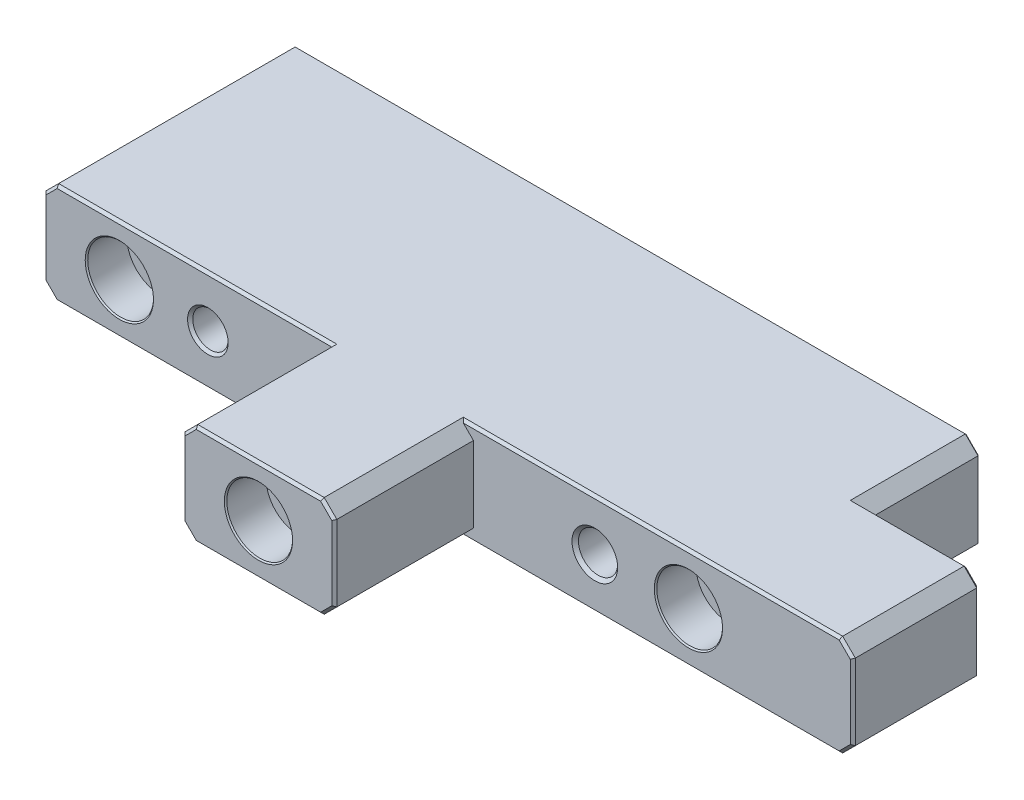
from build123d import *

# Parameters (mm, degrees)
ESQUISSE1_W                          = 320
ESQUISSE1_H                          = 40
VOLUME_DEPTH                         = 150
ESQUISSE5_W                          = 170
ESQUISSE5_H                          = 75
ESQUISSE5_W_2                        = 65
ESQUISSE5_H_2                        = 70
ESQUISSE5_W_3                        = 130
EVIDEMMENTS_DEPTH                    = 356.668384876
LAMAGE_VIS_M16_D                     = 17.5
LAMAGE_VIS_M16_CBORE_D               = 26
LAMAGE_VIS_M16_CBORE_DEPTH           = 16
LAMAGE_VIS_M16_ON_FACE_2_D           = 17.5
LAMAGE_VIS_M16_ON_FACE_2_CBORE_D     = 26
LAMAGE_VIS_M16_ON_FACE_2_CBORE_DEPTH = 16
TROU_TARAUD_M18_D                    = 15.5
TROU_TARAUD_M18_DEPTH                = 48.5
TROU_TARAUD_M18_CSINK_D              = 18.05
TROU_TARAUD_M18_CSINK_ANGLE          = 90
TROU_TARAUD_M18_TIP                  = 4.656669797
TROU_TARAUD_M16_D                    = 14
TROU_TARAUD_M16_DEPTH                = 42
TROU_TARAUD_M16_CSINK_D              = 16.05
TROU_TARAUD_M16_CSINK_ANGLE          = 90
TROU_TARAUD_M16_TIP                  = 4.206024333
TROU_TARAUD_M16_BUT_E_D              = 14
TROU_TARAUD_M16_BUT_E_DEPTH          = 25
TROU_TARAUD_M16_BUT_E_CSINK_D        = 16.05
TROU_TARAUD_M16_BUT_E_CSINK_ANGLE    = 90
TROU_TARAUD_M16_BUT_E_TIP            = 4.206024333
CHANFREINS_5MM_SIZE                  = 5
CHANFREINS_1MM_SIZE                  = 1
CHANFREINS_0_5MM_SIZE                = 0.5


with BuildPart() as part:
    # Esquisse1 → Volume (new body)
    with BuildSketch(Plane.XY):
        with Locations((160, 20)):
            Rectangle(ESQUISSE1_W, ESQUISSE1_H)
    extrude(amount=VOLUME_DEPTH)

    # Esquisse5 → Evidemments (cut, through all)
    with BuildSketch(Plane(origin=(0, 40, 0), x_dir=(1, 0, 0), z_dir=(0, 1, 0))):
        with Locations((255, -132.5)):
            Rectangle(ESQUISSE5_W, ESQUISSE5_H)
        with Locations((307.5, -10)):
            Rectangle(ESQUISSE5_W_2, ESQUISSE5_H_2)
        with Locations((45, -132.5)):
            Rectangle(ESQUISSE5_W_3, ESQUISSE5_H)
    extrude(amount=-EVIDEMMENTS_DEPTH, mode=Mode.SUBTRACT)

    # Lamage vis M16 (through all)
    with Locations(Plane(origin=(140, 20, 150), x_dir=(1, 0, 0), z_dir=(0, 0, 1))):
        with Locations((0, 0)):
            CounterBoreHole(LAMAGE_VIS_M16_D / 2, LAMAGE_VIS_M16_CBORE_D / 2, LAMAGE_VIS_M16_CBORE_DEPTH)

    # Lamage vis M16 on face 2 (through all)
    with Locations(Plane(origin=(255, 20, 95), x_dir=(1, 0, 0), z_dir=(0, 0, 1))):
        with Locations((0, 0), (-225, 0)):
            CounterBoreHole(LAMAGE_VIS_M16_ON_FACE_2_D / 2, LAMAGE_VIS_M16_ON_FACE_2_CBORE_D / 2, LAMAGE_VIS_M16_ON_FACE_2_CBORE_DEPTH)

    # Trou taraud_ M18
    with Locations(Plane(origin=(218, 20, 95), x_dir=(1, 0, 0), z_dir=(0, 0, 1))):
        with Locations((0, 0)):
            CounterSinkHole(TROU_TARAUD_M18_D / 2, TROU_TARAUD_M18_CSINK_D / 2, depth=TROU_TARAUD_M18_DEPTH, counter_sink_angle=TROU_TARAUD_M18_CSINK_ANGLE)
            with Locations((0, 0, -(TROU_TARAUD_M18_DEPTH + TROU_TARAUD_M18_TIP / 2))):  # 118° drill point
                Cone(0, TROU_TARAUD_M18_D / 2, TROU_TARAUD_M18_TIP, mode=Mode.SUBTRACT)

    # Trou taraud_ M16
    with Locations(Plane.XY.offset(95)):
        with Locations((65, 20)):
            CounterSinkHole(TROU_TARAUD_M16_D / 2, TROU_TARAUD_M16_CSINK_D / 2, depth=TROU_TARAUD_M16_DEPTH, counter_sink_angle=TROU_TARAUD_M16_CSINK_ANGLE)
            with Locations((0, 0, -(TROU_TARAUD_M16_DEPTH + TROU_TARAUD_M16_TIP / 2))):  # 118° drill point
                Cone(0, TROU_TARAUD_M16_D / 2, TROU_TARAUD_M16_TIP, mode=Mode.SUBTRACT)

    # Trou taraud_ M16 - But_e
    with Locations(Plane.XZ):
        with Locations((300, 70)):
            CounterSinkHole(TROU_TARAUD_M16_BUT_E_D / 2, TROU_TARAUD_M16_BUT_E_CSINK_D / 2, depth=TROU_TARAUD_M16_BUT_E_DEPTH, counter_sink_angle=TROU_TARAUD_M16_BUT_E_CSINK_ANGLE)
            with Locations((0, 0, -(TROU_TARAUD_M16_BUT_E_DEPTH + TROU_TARAUD_M16_BUT_E_TIP / 2))):  # 118° drill point
                Cone(0, TROU_TARAUD_M16_BUT_E_D / 2, TROU_TARAUD_M16_BUT_E_TIP, mode=Mode.SUBTRACT)

    # Chanfreins 5mm
    chanfreins_5mm_edges = [part.edges().sort_by_distance(p)[0] for p in [
        (320, 40, 70),
        (320, 0, 70),
        (170, 40, 122.5),
        (170, 0, 122.5),
        (0, 0, 47.5),
        (0, 40, 47.5),
        (110, 40, 122.5),
        (110, 0, 122.5),
        (275, 0, 22.5),
        (275, 40, 22.5),
    ]]
    chamfer(chanfreins_5mm_edges, length=CHANFREINS_5MM_SIZE)

    # Chanfreins 1mm
    chanfreins_1mm_edges = [part.edges().sort_by_distance(p)[0] for p in [
        (110, 20, 150),
        (140, 40, 150),
        (240, 40, 95),
        (140, 0, 150),
        (170, 20, 150),
        (167.5, 2.5, 150),
        (167.5, 37.5, 150),
        (112.5, 2.5, 150),
        (112.5, 37.5, 150),
        (240, 0, 95),
        (320, 20, 45),
        (320, 20, 95),
        (317.5, 37.5, 45),
        (317.5, 2.5, 45),
        (317.5, 37.5, 95),
        (317.5, 2.5, 95),
        (0, 20, 95),
        (2.5, 37.5, 95),
        (2.5, 2.5, 95),
        (60, 0, 95),
        (60, 40, 95),
        (292.5, 0, 45),
        (292.5, 40, 45),
    ]]
    chamfer(chanfreins_1mm_edges, length=CHANFREINS_1MM_SIZE)

    # Chanfreins 0.5mm
    chanfreins_0_5mm_edges = [part.edges().sort_by_distance(p)[0] for p in [
        (137.5, 40, 0),
        (137.5, 0, 0),
        (275, 20, 0),
        (0, 20, 0),
        (2.5, 37.5, 0),
        (2.5, 2.5, 0),
        (272.5, 37.5, 0),
        (272.5, 2.5, 0),
        (17, 20, 95),
        (38.75, 20, 0),
        (242, 20, 95),
        (263.75, 20, 0),
        (127, 20, 150),
        (148.75, 20, 0),
    ]]
    chamfer(chanfreins_0_5mm_edges, length=CHANFREINS_0_5MM_SIZE)


solid = part.part
